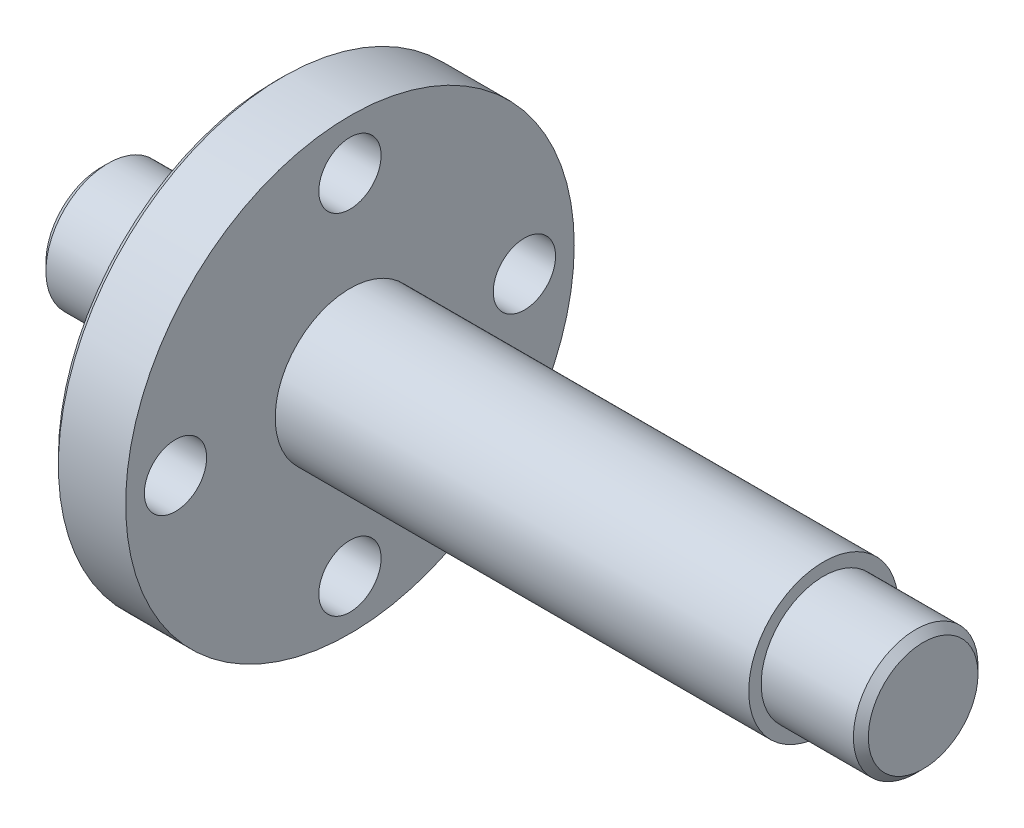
ISO-10303-21;
HEADER;
FILE_DESCRIPTION(('STEP AP214'),'2;1');
FILE_NAME('part.step','',(''),(''),'','','');
FILE_SCHEMA(('AUTOMOTIVE_DESIGN { 1 0 10303 214 1 1 1 1 }'));
ENDSEC;
DATA;
#1=APPLICATION_CONTEXT('core data for automotive mechanical design processes');
#2=APPLICATION_PROTOCOL_DEFINITION('international standard','automotive_design',2000,#1);
#3=PRODUCT_CONTEXT('',#1,'mechanical');
#4=PRODUCT('Part','Part','',(#3));
#5=PRODUCT_RELATED_PRODUCT_CATEGORY('part','',(#4));
#6=PRODUCT_DEFINITION_FORMATION('','',#4);
#7=PRODUCT_DEFINITION_CONTEXT('part definition',#1,'design');
#8=PRODUCT_DEFINITION('design','',#6,#7);
#9=PRODUCT_DEFINITION_SHAPE('','',#8);
#10=(LENGTH_UNIT() NAMED_UNIT(*) SI_UNIT(.MILLI.,.METRE.));
#11=(NAMED_UNIT(*) PLANE_ANGLE_UNIT() SI_UNIT($,.RADIAN.));
#12=(NAMED_UNIT(*) SI_UNIT($,.STERADIAN.) SOLID_ANGLE_UNIT());
#13=UNCERTAINTY_MEASURE_WITH_UNIT(LENGTH_MEASURE(1.E-05),#10,'distance_accuracy_value','');
#14=(GEOMETRIC_REPRESENTATION_CONTEXT(3) GLOBAL_UNCERTAINTY_ASSIGNED_CONTEXT((#13)) GLOBAL_UNIT_ASSIGNED_CONTEXT((#10,
#11,#12)) REPRESENTATION_CONTEXT('',''));
#15=CARTESIAN_POINT('',(0.,0.,0.));
#16=DIRECTION('',(0.,0.,1.));
#17=DIRECTION('',(1.,0.,0.));
#18=AXIS2_PLACEMENT_3D('',#15,#16,#17);
#19=CARTESIAN_POINT('',(44.,0.,0.));
#20=DIRECTION('',(1.,0.,0.));
#21=DIRECTION('',(0.,0.,-1.));
#22=AXIS2_PLACEMENT_3D('',#19,#20,#21);
#23=PLANE('',#22);
#24=CARTESIAN_POINT('',(44.,0.,0.));
#25=DIRECTION('',(1.,0.,0.));
#26=DIRECTION('',(0.,0.,-1.));
#27=AXIS2_PLACEMENT_3D('',#24,#25,#26);
#28=CIRCLE('',#27,3.);
#29=CARTESIAN_POINT('',(44.,0.,-3.));
#30=VERTEX_POINT('',#29);
#31=EDGE_CURVE('E161',#30,#30,#28,.T.);
#32=ORIENTED_EDGE('',*,*,#31,.T.);
#33=EDGE_LOOP('',(#32));
#34=FACE_BOUND('',#33,.T.);
#35=CARTESIAN_POINT('',(44.,0.,0.));
#36=DIRECTION('',(1.,0.,0.));
#37=DIRECTION('',(0.,0.,-1.));
#38=AXIS2_PLACEMENT_3D('',#35,#36,#37);
#39=CIRCLE('',#38,2.5);
#40=CARTESIAN_POINT('',(44.,0.,-2.5));
#41=VERTEX_POINT('',#40);
#42=EDGE_CURVE('E165',#41,#41,#39,.T.);
#43=ORIENTED_EDGE('',*,*,#42,.F.);
#44=EDGE_LOOP('',(#43));
#45=FACE_BOUND('',#44,.T.);
#46=ADVANCED_FACE('F36',(#34,#45),#23,.T.);
#47=CARTESIAN_POINT('',(25.,0.,0.));
#48=DIRECTION('',(1.,0.,0.));
#49=DIRECTION('',(0.,0.,-1.));
#50=AXIS2_PLACEMENT_3D('',#47,#48,#49);
#51=PLANE('',#50);
#52=CARTESIAN_POINT('',(25.,0.,-7.));
#53=DIRECTION('',(1.,0.,0.));
#54=DIRECTION('',(0.,0.,-1.));
#55=AXIS2_PLACEMENT_3D('',#52,#53,#54);
#56=CIRCLE('',#55,1.24999999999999);
#57=CARTESIAN_POINT('',(25.,0.,-8.24999999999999));
#58=VERTEX_POINT('',#57);
#59=EDGE_CURVE('E187',#58,#58,#56,.T.);
#60=ORIENTED_EDGE('',*,*,#59,.F.);
#61=EDGE_LOOP('',(#60));
#62=FACE_BOUND('',#61,.T.);
#63=CARTESIAN_POINT('',(25.,-7.,0.));
#64=DIRECTION('',(1.,0.,0.));
#65=DIRECTION('',(0.,0.,-1.));
#66=AXIS2_PLACEMENT_3D('',#63,#64,#65);
#67=CIRCLE('',#66,1.24999999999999);
#68=CARTESIAN_POINT('',(25.,-7.,-1.24999999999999));
#69=VERTEX_POINT('',#68);
#70=EDGE_CURVE('E181',#69,#69,#67,.T.);
#71=ORIENTED_EDGE('',*,*,#70,.F.);
#72=EDGE_LOOP('',(#71));
#73=FACE_BOUND('',#72,.T.);
#74=CARTESIAN_POINT('',(25.,0.,7.));
#75=DIRECTION('',(1.,0.,0.));
#76=DIRECTION('',(0.,0.,-1.));
#77=AXIS2_PLACEMENT_3D('',#74,#75,#76);
#78=CIRCLE('',#77,1.24999999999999);
#79=CARTESIAN_POINT('',(25.,0.,5.75000000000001));
#80=VERTEX_POINT('',#79);
#81=EDGE_CURVE('E175',#80,#80,#78,.T.);
#82=ORIENTED_EDGE('',*,*,#81,.F.);
#83=EDGE_LOOP('',(#82));
#84=FACE_BOUND('',#83,.T.);
#85=CARTESIAN_POINT('',(25.,7.,0.));
#86=DIRECTION('',(1.,0.,0.));
#87=DIRECTION('',(0.,0.,-1.));
#88=AXIS2_PLACEMENT_3D('',#85,#86,#87);
#89=CIRCLE('',#88,1.24999999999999);
#90=CARTESIAN_POINT('',(25.,7.,-1.24999999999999));
#91=VERTEX_POINT('',#90);
#92=EDGE_CURVE('E169',#91,#91,#89,.T.);
#93=ORIENTED_EDGE('',*,*,#92,.F.);
#94=EDGE_LOOP('',(#93));
#95=FACE_BOUND('',#94,.T.);
#96=CARTESIAN_POINT('',(25.,0.,0.));
#97=DIRECTION('',(1.,0.,0.));
#98=DIRECTION('',(0.,0.,-1.));
#99=AXIS2_PLACEMENT_3D('',#96,#97,#98);
#100=CIRCLE('',#99,9.);
#101=CARTESIAN_POINT('',(25.,0.,-9.));
#102=VERTEX_POINT('',#101);
#103=EDGE_CURVE('E156',#102,#102,#100,.T.);
#104=ORIENTED_EDGE('',*,*,#103,.T.);
#105=EDGE_LOOP('',(#104));
#106=FACE_BOUND('',#105,.T.);
#107=CARTESIAN_POINT('',(25.,0.,0.));
#108=DIRECTION('',(1.,0.,0.));
#109=DIRECTION('',(0.,0.,-1.));
#110=AXIS2_PLACEMENT_3D('',#107,#108,#109);
#111=CIRCLE('',#110,3.);
#112=CARTESIAN_POINT('',(25.,0.,-3.));
#113=VERTEX_POINT('',#112);
#114=EDGE_CURVE('E162',#113,#113,#111,.T.);
#115=ORIENTED_EDGE('',*,*,#114,.F.);
#116=EDGE_LOOP('',(#115));
#117=FACE_BOUND('',#116,.T.);
#118=ADVANCED_FACE('F83',(#62,#73,#84,#95,#106,#117),#51,.T.);
#119=CARTESIAN_POINT('',(15.,0.,0.));
#120=DIRECTION('',(1.,0.,0.));
#121=DIRECTION('',(0.,0.,-1.));
#122=AXIS2_PLACEMENT_3D('',#119,#120,#121);
#123=PLANE('',#122);
#124=CARTESIAN_POINT('',(15.,0.,0.));
#125=DIRECTION('',(1.,0.,0.));
#126=DIRECTION('',(0.,0.,-1.));
#127=AXIS2_PLACEMENT_3D('',#124,#125,#126);
#128=CIRCLE('',#127,2.2);
#129=CARTESIAN_POINT('',(15.,0.,-2.2));
#130=VERTEX_POINT('',#129);
#131=EDGE_CURVE('E10',#130,#130,#128,.F.);
#132=ORIENTED_EDGE('',*,*,#131,.T.);
#133=EDGE_LOOP('',(#132));
#134=FACE_BOUND('',#133,.T.);
#135=CARTESIAN_POINT('',(15.,0.,0.));
#136=DIRECTION('',(-1.,0.,0.));
#137=DIRECTION('',(0.,0.,1.));
#138=AXIS2_PLACEMENT_3D('',#135,#136,#137);
#139=CIRCLE('',#138,1.5);
#140=CARTESIAN_POINT('',(15.,0.,1.5));
#141=VERTEX_POINT('',#140);
#142=EDGE_CURVE('E192',#141,#141,#139,.T.);
#143=ORIENTED_EDGE('',*,*,#142,.F.);
#144=EDGE_LOOP('',(#143));
#145=FACE_BOUND('',#144,.T.);
#146=ADVANCED_FACE('F89',(#134,#145),#123,.F.);
#147=CARTESIAN_POINT('',(19.,0.,0.));
#148=DIRECTION('',(-1.,0.,0.));
#149=DIRECTION('',(0.,0.,1.));
#150=AXIS2_PLACEMENT_3D('',#147,#148,#149);
#151=CYLINDRICAL_SURFACE('',#150,2.5);
#152=CARTESIAN_POINT('',(15.3,0.,0.));
#153=DIRECTION('',(1.,0.,0.));
#154=DIRECTION('',(0.,0.,-1.));
#155=AXIS2_PLACEMENT_3D('',#152,#153,#154);
#156=CIRCLE('',#155,2.5);
#157=CARTESIAN_POINT('',(15.3,0.,-2.5));
#158=VERTEX_POINT('',#157);
#159=EDGE_CURVE('E43',#158,#158,#156,.T.);
#160=ORIENTED_EDGE('',*,*,#159,.T.);
#161=EDGE_LOOP('',(#160));
#162=FACE_BOUND('',#161,.T.);
#163=CARTESIAN_POINT('',(19.,0.,0.));
#164=DIRECTION('',(1.,0.,0.));
#165=DIRECTION('',(0.,0.,-1.));
#166=AXIS2_PLACEMENT_3D('',#163,#164,#165);
#167=CIRCLE('',#166,2.5);
#168=CARTESIAN_POINT('',(19.,0.,-2.5));
#169=VERTEX_POINT('',#168);
#170=EDGE_CURVE('E149',#169,#169,#167,.T.);
#171=ORIENTED_EDGE('',*,*,#170,.F.);
#172=EDGE_LOOP('',(#171));
#173=FACE_BOUND('',#172,.T.);
#174=ADVANCED_FACE('F113',(#162,#173),#151,.T.);
#175=CARTESIAN_POINT('',(19.,0.,0.));
#176=DIRECTION('',(1.,0.,0.));
#177=DIRECTION('',(0.,0.,-1.));
#178=AXIS2_PLACEMENT_3D('',#175,#176,#177);
#179=PLANE('',#178);
#180=CARTESIAN_POINT('',(19.,0.,0.));
#181=DIRECTION('',(1.,0.,0.));
#182=DIRECTION('',(0.,0.,-1.));
#183=AXIS2_PLACEMENT_3D('',#180,#181,#182);
#184=CIRCLE('',#183,3.);
#185=CARTESIAN_POINT('',(19.,0.,-3.));
#186=VERTEX_POINT('',#185);
#187=EDGE_CURVE('E153',#186,#186,#184,.T.);
#188=ORIENTED_EDGE('',*,*,#187,.F.);
#189=EDGE_LOOP('',(#188));
#190=FACE_BOUND('',#189,.T.);
#191=ORIENTED_EDGE('',*,*,#170,.T.);
#192=EDGE_LOOP('',(#191));
#193=FACE_BOUND('',#192,.T.);
#194=ADVANCED_FACE('F111',(#190,#193),#179,.F.);
#195=CARTESIAN_POINT('',(22.,0.,0.));
#196=DIRECTION('',(-1.,0.,0.));
#197=DIRECTION('',(0.,0.,1.));
#198=AXIS2_PLACEMENT_3D('',#195,#196,#197);
#199=CYLINDRICAL_SURFACE('',#198,3.);
#200=CARTESIAN_POINT('',(19.475,2.12132034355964,-2.12132034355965));
#201=CARTESIAN_POINT('',(19.4749994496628,2.08183053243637,-2.16081067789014));
#202=CARTESIAN_POINT('',(19.4795790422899,2.04123014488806,-2.19918499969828));
#203=CARTESIAN_POINT('',(19.4977169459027,1.95909170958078,-2.27266305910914));
#204=CARTESIAN_POINT('',(19.5112757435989,1.91755361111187,-2.30776661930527));
#205=CARTESIAN_POINT('',(19.5468496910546,1.83502148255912,-2.37391899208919));
#206=CARTESIAN_POINT('',(19.5688502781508,1.79402664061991,-2.40497466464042));
#207=CARTESIAN_POINT('',(19.6206158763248,1.71390737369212,-2.4627146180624));
#208=CARTESIAN_POINT('',(19.6503825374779,1.67478334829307,-2.4893979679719));
#209=CARTESIAN_POINT('',(19.7179648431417,1.59855037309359,-2.53904996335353));
#210=CARTESIAN_POINT('',(19.7560112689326,1.56154870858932,-2.56186913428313));
#211=CARTESIAN_POINT('',(19.8385826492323,1.49244550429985,-2.6027334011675));
#212=CARTESIAN_POINT('',(19.8831091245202,1.4603451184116,-2.62077737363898));
#213=CARTESIAN_POINT('',(19.9790376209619,1.40156887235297,-2.65268918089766));
#214=CARTESIAN_POINT('',(20.0306078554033,1.37508819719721,-2.66641294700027));
#215=CARTESIAN_POINT('',(20.1381553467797,1.33026886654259,-2.6890555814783));
#216=CARTESIAN_POINT('',(20.1941311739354,1.31192758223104,-2.69797600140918));
#217=CARTESIAN_POINT('',(20.3068306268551,1.28501655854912,-2.71089460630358));
#218=CARTESIAN_POINT('',(20.3634587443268,1.27612589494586,-2.71505484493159));
#219=CARTESIAN_POINT('',(20.4775508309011,1.2675795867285,-2.71905616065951));
#220=CARTESIAN_POINT('',(20.5350145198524,1.26792091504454,-2.71889865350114));
#221=CARTESIAN_POINT('',(20.6461954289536,1.27756478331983,-2.71437871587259));
#222=CARTESIAN_POINT('',(20.6999594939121,1.28643343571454,-2.71021987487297));
#223=CARTESIAN_POINT('',(20.8051273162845,1.31197142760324,-2.69794914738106));
#224=CARTESIAN_POINT('',(20.8565307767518,1.32864174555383,-2.68983676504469));
#225=CARTESIAN_POINT('',(20.9565219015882,1.36923073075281,-2.66940610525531));
#226=CARTESIAN_POINT('',(21.0050482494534,1.39326573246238,-2.65701988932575));
#227=CARTESIAN_POINT('',(21.0972308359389,1.44733716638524,-2.62795647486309));
#228=CARTESIAN_POINT('',(21.1408856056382,1.47737540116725,-2.61127798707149));
#229=CARTESIAN_POINT('',(21.2246119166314,1.54400376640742,-2.57247276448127));
#230=CARTESIAN_POINT('',(21.2643540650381,1.58086348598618,-2.55009671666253));
#231=CARTESIAN_POINT('',(21.3363383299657,1.65837887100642,-2.5003793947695));
#232=CARTESIAN_POINT('',(21.3685796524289,1.69903493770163,-2.4730375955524));
#233=CARTESIAN_POINT('',(21.4249303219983,1.78303607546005,-2.41318606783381));
#234=CARTESIAN_POINT('',(21.4489473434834,1.82640559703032,-2.38062333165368));
#235=CARTESIAN_POINT('',(21.4875046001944,1.91373952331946,-2.31099840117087));
#236=CARTESIAN_POINT('',(21.5020483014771,1.95770370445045,-2.27393785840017));
#237=CARTESIAN_POINT('',(21.5206530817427,2.0425987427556,-2.19792832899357));
#238=CARTESIAN_POINT('',(21.5251589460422,2.08357681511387,-2.15914080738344));
#239=CARTESIAN_POINT('',(21.5248325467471,2.16323793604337,-2.07932170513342));
#240=CARTESIAN_POINT('',(21.5200019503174,2.20192139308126,-2.03829052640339));
#241=CARTESIAN_POINT('',(21.5014893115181,2.27478481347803,-1.95659422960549));
#242=CARTESIAN_POINT('',(21.4880837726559,2.30906662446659,-1.91595659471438));
#243=CARTESIAN_POINT('',(21.4531509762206,2.37380679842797,-1.83513611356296));
#244=CARTESIAN_POINT('',(21.4316226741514,2.40426466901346,-1.79495332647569));
#245=CARTESIAN_POINT('',(21.3804131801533,2.46174646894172,-1.71530840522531));
#246=CARTESIAN_POINT('',(21.3505274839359,2.48865542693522,-1.67589505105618));
#247=CARTESIAN_POINT('',(21.2836898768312,2.53790663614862,-1.60033354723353));
#248=CARTESIAN_POINT('',(21.2467357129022,2.56024742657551,-1.56418644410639));
#249=CARTESIAN_POINT('',(21.1647203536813,2.60134825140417,-1.49488756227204));
#250=CARTESIAN_POINT('',(21.1193558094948,2.61988574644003,-1.46196192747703));
#251=CARTESIAN_POINT('',(21.0229481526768,2.65209803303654,-1.40268238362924));
#252=CARTESIAN_POINT('',(20.9719049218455,2.66577272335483,-1.3763286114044));
#253=CARTESIAN_POINT('',(20.8655030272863,2.68839022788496,-1.33161139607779));
#254=CARTESIAN_POINT('',(20.8101490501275,2.69733810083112,-1.31323941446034));
#255=CARTESIAN_POINT('',(20.6966910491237,2.71062596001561,-1.2855919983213));
#256=CARTESIAN_POINT('',(20.6385883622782,2.71496816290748,-1.27631218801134));
#257=CARTESIAN_POINT('',(20.5246525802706,2.71899283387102,-1.26771377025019));
#258=CARTESIAN_POINT('',(20.4688659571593,2.71891384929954,-1.26788520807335));
#259=CARTESIAN_POINT('',(20.3581622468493,2.7146849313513,-1.27691425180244));
#260=CARTESIAN_POINT('',(20.3032451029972,2.71053526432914,-1.28577128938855));
#261=CARTESIAN_POINT('',(20.1969908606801,2.69825135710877,-1.31134779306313));
#262=CARTESIAN_POINT('',(20.1456028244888,2.69020254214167,-1.32789840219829));
#263=CARTESIAN_POINT('',(20.0464364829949,2.67007779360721,-1.3679121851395));
#264=CARTESIAN_POINT('',(19.9986590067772,2.65800093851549,-1.39137694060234));
#265=CARTESIAN_POINT('',(19.9057159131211,2.62906423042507,-1.44533656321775));
#266=CARTESIAN_POINT('',(19.8607675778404,2.61201200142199,-1.47610239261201));
#267=CARTESIAN_POINT('',(19.777012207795,2.57325730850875,-1.54266924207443));
#268=CARTESIAN_POINT('',(19.7382069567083,2.55155349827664,-1.57847171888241));
#269=CARTESIAN_POINT('',(19.6662031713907,2.50243121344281,-1.65529415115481));
#270=CARTESIAN_POINT('',(19.6333061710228,2.47481206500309,-1.69646948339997));
#271=CARTESIAN_POINT('',(19.5761877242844,2.4145913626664,-1.78113516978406));
#272=CARTESIAN_POINT('',(19.5519645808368,2.38199078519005,-1.82462506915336));
#273=CARTESIAN_POINT('',(19.5135836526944,2.31322464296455,-1.91100802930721));
#274=CARTESIAN_POINT('',(19.49916315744,2.27718437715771,-1.95388373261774));
#275=CARTESIAN_POINT('',(19.4798731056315,2.2015959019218,-2.03867524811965));
#276=CARTESIAN_POINT('',(19.4750005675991,2.16204879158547,-2.08059135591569));
#277=CARTESIAN_POINT('',(19.475,2.12132034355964,-2.12132034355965));
#278=B_SPLINE_CURVE_WITH_KNOTS('',3,(#200,#201,#202,#203,#204,#205,#206,#207,#208,#209,#210,
#211,#212,#213,#214,#215,#216,#217,#218,#219,#220,#221,#222,#223,#224,#225,#226,#227,#228,#229,
#230,#231,#232,#233,#234,#235,#236,#237,#238,#239,#240,#241,#242,#243,#244,#245,#246,#247,#248,
#249,#250,#251,#252,#253,#254,#255,#256,#257,#258,#259,#260,#261,#262,#263,#264,#265,#266,#267,
#268,#269,#270,#271,#272,#273,#274,#275,#276,#277),.UNSPECIFIED.,.T.,.F.,(4,2,2,2,2,2,2,2,2,2,2,
2,2,2,2,2,2,2,2,2,2,2,2,2,2,2,2,2,2,2,2,2,2,2,2,2,2,2,4),(0.,0.167330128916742,
0.334669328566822,0.501721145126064,0.668808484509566,0.841343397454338,1.01391886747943,
1.19175498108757,1.36953361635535,1.54106091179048,1.71253196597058,1.87571592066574,
2.03892034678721,2.20484873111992,2.37082701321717,2.54593923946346,2.72106999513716,
2.89810683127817,3.07507885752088,3.24403854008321,3.41296805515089,3.57670753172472,
3.7404680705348,3.90865179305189,4.07688921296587,4.25317821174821,4.42947088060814,
4.60557449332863,4.78159331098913,4.94812460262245,5.11464499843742,5.27767170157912,
5.44073572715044,5.61120817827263,5.78173003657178,5.95936758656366,6.13697036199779,
6.30960288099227,6.48218148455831),.UNSPECIFIED.);
#279=CARTESIAN_POINT('',(19.475,2.12132034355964,-2.12132034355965));
#280=VERTEX_POINT('',#279);
#281=EDGE_CURVE('E47',#280,#280,#278,.T.);
#282=ORIENTED_EDGE('',*,*,#281,.T.);
#283=EDGE_LOOP('',(#282));
#284=FACE_BOUND('',#283,.T.);
#285=CARTESIAN_POINT('',(22.,0.,0.));
#286=DIRECTION('',(1.,0.,0.));
#287=DIRECTION('',(0.,0.,-1.));
#288=AXIS2_PLACEMENT_3D('',#285,#286,#287);
#289=CIRCLE('',#288,3.);
#290=CARTESIAN_POINT('',(22.,0.,-3.));
#291=VERTEX_POINT('',#290);
#292=EDGE_CURVE('E152',#291,#291,#289,.T.);
#293=ORIENTED_EDGE('',*,*,#292,.F.);
#294=EDGE_LOOP('',(#293));
#295=FACE_BOUND('',#294,.T.);
#296=ORIENTED_EDGE('',*,*,#187,.T.);
#297=EDGE_LOOP('',(#296));
#298=FACE_BOUND('',#297,.T.);
#299=ADVANCED_FACE('F106',(#284,#295,#298),#199,.T.);
#300=CARTESIAN_POINT('',(22.,0.,0.));
#301=DIRECTION('',(1.,0.,0.));
#302=DIRECTION('',(0.,0.,-1.));
#303=AXIS2_PLACEMENT_3D('',#300,#301,#302);
#304=PLANE('',#303);
#305=CARTESIAN_POINT('',(22.,0.,0.));
#306=DIRECTION('',(1.,0.,0.));
#307=DIRECTION('',(0.,0.,-1.));
#308=AXIS2_PLACEMENT_3D('',#305,#306,#307);
#309=CIRCLE('',#308,8.70000000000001);
#310=CARTESIAN_POINT('',(22.,0.,-8.70000000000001));
#311=VERTEX_POINT('',#310);
#312=EDGE_CURVE('E141',#311,#311,#309,.F.);
#313=ORIENTED_EDGE('',*,*,#312,.T.);
#314=EDGE_LOOP('',(#313));
#315=FACE_BOUND('',#314,.T.);
#316=CARTESIAN_POINT('',(22.,0.,-7.));
#317=DIRECTION('',(-1.,0.,0.));
#318=DIRECTION('',(0.,0.,1.));
#319=AXIS2_PLACEMENT_3D('',#316,#317,#318);
#320=CIRCLE('',#319,1.24999999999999);
#321=CARTESIAN_POINT('',(22.,0.,-5.75000000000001));
#322=VERTEX_POINT('',#321);
#323=EDGE_CURVE('E60',#322,#322,#320,.T.);
#324=ORIENTED_EDGE('',*,*,#323,.F.);
#325=EDGE_LOOP('',(#324));
#326=FACE_BOUND('',#325,.T.);
#327=CARTESIAN_POINT('',(22.,-7.,0.));
#328=DIRECTION('',(-1.,0.,0.));
#329=DIRECTION('',(0.,0.,1.));
#330=AXIS2_PLACEMENT_3D('',#327,#328,#329);
#331=CIRCLE('',#330,1.24999999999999);
#332=CARTESIAN_POINT('',(22.,-7.,1.24999999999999));
#333=VERTEX_POINT('',#332);
#334=EDGE_CURVE('E184',#333,#333,#331,.T.);
#335=ORIENTED_EDGE('',*,*,#334,.F.);
#336=EDGE_LOOP('',(#335));
#337=FACE_BOUND('',#336,.T.);
#338=CARTESIAN_POINT('',(22.,0.,7.));
#339=DIRECTION('',(-1.,0.,0.));
#340=DIRECTION('',(0.,0.,1.));
#341=AXIS2_PLACEMENT_3D('',#338,#339,#340);
#342=CIRCLE('',#341,1.24999999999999);
#343=CARTESIAN_POINT('',(22.,0.,8.24999999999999));
#344=VERTEX_POINT('',#343);
#345=EDGE_CURVE('E178',#344,#344,#342,.T.);
#346=ORIENTED_EDGE('',*,*,#345,.F.);
#347=EDGE_LOOP('',(#346));
#348=FACE_BOUND('',#347,.T.);
#349=CARTESIAN_POINT('',(22.,7.,0.));
#350=DIRECTION('',(-1.,0.,0.));
#351=DIRECTION('',(0.,0.,1.));
#352=AXIS2_PLACEMENT_3D('',#349,#350,#351);
#353=CIRCLE('',#352,1.24999999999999);
#354=CARTESIAN_POINT('',(22.,7.,1.24999999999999));
#355=VERTEX_POINT('',#354);
#356=EDGE_CURVE('E172',#355,#355,#353,.T.);
#357=ORIENTED_EDGE('',*,*,#356,.F.);
#358=EDGE_LOOP('',(#357));
#359=FACE_BOUND('',#358,.T.);
#360=ORIENTED_EDGE('',*,*,#292,.T.);
#361=EDGE_LOOP('',(#360));
#362=FACE_BOUND('',#361,.T.);
#363=ADVANCED_FACE('F103',(#315,#326,#337,#348,#359,#362),#304,.F.);
#364=CARTESIAN_POINT('',(25.,0.,0.));
#365=DIRECTION('',(-1.,0.,0.));
#366=DIRECTION('',(0.,0.,1.));
#367=AXIS2_PLACEMENT_3D('',#364,#365,#366);
#368=CYLINDRICAL_SURFACE('',#367,9.);
#369=CARTESIAN_POINT('',(22.3,0.,0.));
#370=DIRECTION('',(1.,0.,0.));
#371=DIRECTION('',(0.,0.,-1.));
#372=AXIS2_PLACEMENT_3D('',#369,#370,#371);
#373=CIRCLE('',#372,9.);
#374=CARTESIAN_POINT('',(22.3,0.,-9.));
#375=VERTEX_POINT('',#374);
#376=EDGE_CURVE('E144',#375,#375,#373,.T.);
#377=ORIENTED_EDGE('',*,*,#376,.T.);
#378=EDGE_LOOP('',(#377));
#379=FACE_BOUND('',#378,.T.);
#380=ORIENTED_EDGE('',*,*,#103,.F.);
#381=EDGE_LOOP('',(#380));
#382=FACE_BOUND('',#381,.T.);
#383=ADVANCED_FACE('F100',(#379,#382),#368,.T.);
#384=CARTESIAN_POINT('',(44.,0.,0.));
#385=DIRECTION('',(-1.,0.,0.));
#386=DIRECTION('',(0.,0.,1.));
#387=AXIS2_PLACEMENT_3D('',#384,#385,#386);
#388=CYLINDRICAL_SURFACE('',#387,3.);
#389=ORIENTED_EDGE('',*,*,#31,.F.);
#390=EDGE_LOOP('',(#389));
#391=FACE_BOUND('',#390,.T.);
#392=ORIENTED_EDGE('',*,*,#114,.T.);
#393=EDGE_LOOP('',(#392));
#394=FACE_BOUND('',#393,.T.);
#395=ADVANCED_FACE('F98',(#391,#394),#388,.T.);
#396=CARTESIAN_POINT('',(48.,0.,0.));
#397=DIRECTION('',(-1.,0.,0.));
#398=DIRECTION('',(0.,0.,1.));
#399=AXIS2_PLACEMENT_3D('',#396,#397,#398);
#400=CYLINDRICAL_SURFACE('',#399,2.5);
#401=CARTESIAN_POINT('',(47.7,0.,0.));
#402=DIRECTION('',(1.,0.,0.));
#403=DIRECTION('',(0.,0.,-1.));
#404=AXIS2_PLACEMENT_3D('',#401,#402,#403);
#405=CIRCLE('',#404,2.5);
#406=CARTESIAN_POINT('',(47.7,0.,-2.5));
#407=VERTEX_POINT('',#406);
#408=EDGE_CURVE('E51',#407,#407,#405,.F.);
#409=ORIENTED_EDGE('',*,*,#408,.T.);
#410=EDGE_LOOP('',(#409));
#411=FACE_BOUND('',#410,.T.);
#412=ORIENTED_EDGE('',*,*,#42,.T.);
#413=EDGE_LOOP('',(#412));
#414=FACE_BOUND('',#413,.T.);
#415=ADVANCED_FACE('F96',(#411,#414),#400,.T.);
#416=CARTESIAN_POINT('',(48.,0.,0.));
#417=DIRECTION('',(1.,0.,0.));
#418=DIRECTION('',(0.,0.,-1.));
#419=AXIS2_PLACEMENT_3D('',#416,#417,#418);
#420=PLANE('',#419);
#421=CARTESIAN_POINT('',(48.,0.,0.));
#422=DIRECTION('',(1.,0.,0.));
#423=DIRECTION('',(0.,0.,-1.));
#424=AXIS2_PLACEMENT_3D('',#421,#422,#423);
#425=CIRCLE('',#424,2.20000000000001);
#426=CARTESIAN_POINT('',(48.,0.,-2.20000000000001));
#427=VERTEX_POINT('',#426);
#428=EDGE_CURVE('E139',#427,#427,#425,.T.);
#429=ORIENTED_EDGE('',*,*,#428,.T.);
#430=EDGE_LOOP('',(#429));
#431=FACE_BOUND('',#430,.T.);
#432=ADVANCED_FACE('F226',(#431),#420,.T.);
#433=CARTESIAN_POINT('',(22.,7.,0.));
#434=DIRECTION('',(-1.,0.,0.));
#435=DIRECTION('',(0.,0.,1.));
#436=AXIS2_PLACEMENT_3D('',#433,#434,#435);
#437=CYLINDRICAL_SURFACE('',#436,1.24999999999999);
#438=ORIENTED_EDGE('',*,*,#356,.T.);
#439=EDGE_LOOP('',(#438));
#440=FACE_BOUND('',#439,.T.);
#441=ORIENTED_EDGE('',*,*,#92,.T.);
#442=EDGE_LOOP('',(#441));
#443=FACE_BOUND('',#442,.T.);
#444=ADVANCED_FACE('F222',(#440,#443),#437,.F.);
#445=CARTESIAN_POINT('',(22.,0.,7.));
#446=DIRECTION('',(-1.,0.,0.));
#447=DIRECTION('',(0.,0.,1.));
#448=AXIS2_PLACEMENT_3D('',#445,#446,#447);
#449=CYLINDRICAL_SURFACE('',#448,1.24999999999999);
#450=ORIENTED_EDGE('',*,*,#345,.T.);
#451=EDGE_LOOP('',(#450));
#452=FACE_BOUND('',#451,.T.);
#453=ORIENTED_EDGE('',*,*,#81,.T.);
#454=EDGE_LOOP('',(#453));
#455=FACE_BOUND('',#454,.T.);
#456=ADVANCED_FACE('F225',(#452,#455),#449,.F.);
#457=CARTESIAN_POINT('',(22.,-7.,0.));
#458=DIRECTION('',(-1.,0.,0.));
#459=DIRECTION('',(0.,0.,1.));
#460=AXIS2_PLACEMENT_3D('',#457,#458,#459);
#461=CYLINDRICAL_SURFACE('',#460,1.24999999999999);
#462=ORIENTED_EDGE('',*,*,#334,.T.);
#463=EDGE_LOOP('',(#462));
#464=FACE_BOUND('',#463,.T.);
#465=ORIENTED_EDGE('',*,*,#70,.T.);
#466=EDGE_LOOP('',(#465));
#467=FACE_BOUND('',#466,.T.);
#468=ADVANCED_FACE('F240',(#464,#467),#461,.F.);
#469=CARTESIAN_POINT('',(22.,0.,-7.));
#470=DIRECTION('',(-1.,0.,0.));
#471=DIRECTION('',(0.,0.,1.));
#472=AXIS2_PLACEMENT_3D('',#469,#470,#471);
#473=CYLINDRICAL_SURFACE('',#472,1.24999999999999);
#474=ORIENTED_EDGE('',*,*,#323,.T.);
#475=EDGE_LOOP('',(#474));
#476=FACE_BOUND('',#475,.T.);
#477=ORIENTED_EDGE('',*,*,#59,.T.);
#478=EDGE_LOOP('',(#477));
#479=FACE_BOUND('',#478,.T.);
#480=ADVANCED_FACE('F126',(#476,#479),#473,.F.);
#481=CARTESIAN_POINT('',(22.3,0.,0.));
#482=DIRECTION('',(1.,0.,0.));
#483=DIRECTION('',(0.,0.,-1.));
#484=AXIS2_PLACEMENT_3D('',#481,#482,#483);
#485=CONICAL_SURFACE('',#484,9.,0.78539816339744);
#486=ORIENTED_EDGE('',*,*,#312,.F.);
#487=EDGE_LOOP('',(#486));
#488=FACE_BOUND('',#487,.T.);
#489=ORIENTED_EDGE('',*,*,#376,.F.);
#490=EDGE_LOOP('',(#489));
#491=FACE_BOUND('',#490,.T.);
#492=ADVANCED_FACE('F123',(#488,#491),#485,.T.);
#493=CARTESIAN_POINT('',(48.,0.,0.));
#494=DIRECTION('',(-1.,0.,0.));
#495=DIRECTION('',(0.,0.,1.));
#496=AXIS2_PLACEMENT_3D('',#493,#494,#495);
#497=CONICAL_SURFACE('',#496,2.20000000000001,0.785398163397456);
#498=ORIENTED_EDGE('',*,*,#408,.F.);
#499=EDGE_LOOP('',(#498));
#500=FACE_BOUND('',#499,.T.);
#501=ORIENTED_EDGE('',*,*,#428,.F.);
#502=EDGE_LOOP('',(#501));
#503=FACE_BOUND('',#502,.T.);
#504=ADVANCED_FACE('F125',(#500,#503),#497,.T.);
#505=CARTESIAN_POINT('',(20.5,0.,0.));
#506=DIRECTION('',(0.,-0.707106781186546,0.707106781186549));
#507=DIRECTION('',(0.,-0.707106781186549,-0.707106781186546));
#508=AXIS2_PLACEMENT_3D('',#505,#506,#507);
#509=CYLINDRICAL_SURFACE('',#508,1.025);
#510=CARTESIAN_POINT('',(20.5,0.0496104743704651,-1.49917937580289));
#511=CARTESIAN_POINT('',(20.5496121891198,0.0496184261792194,-1.49918171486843));
#512=CARTESIAN_POINT('',(20.5992532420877,0.0546124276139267,-1.49903927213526));
#513=CARTESIAN_POINT('',(20.6967276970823,0.0738736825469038,-1.49820801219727));
#514=CARTESIAN_POINT('',(20.7445570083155,0.0881607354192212,-1.49751802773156));
#515=CARTESIAN_POINT('',(20.8366650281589,0.124144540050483,-1.49496030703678));
#516=CARTESIAN_POINT('',(20.8809752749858,0.145763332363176,-1.49310479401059));
#517=CARTESIAN_POINT('',(20.9660953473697,0.194780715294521,-1.48750416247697));
#518=CARTESIAN_POINT('',(21.0069046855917,0.222180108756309,-1.48375878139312));
#519=CARTESIAN_POINT('',(21.091244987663,0.2863054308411,-1.47283834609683));
#520=CARTESIAN_POINT('',(21.1341130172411,0.323824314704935,-1.46519916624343));
#521=CARTESIAN_POINT('',(21.21446896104,0.403242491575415,-1.44536330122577));
#522=CARTESIAN_POINT('',(21.251950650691,0.445146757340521,-1.43316140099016));
#523=CARTESIAN_POINT('',(21.3262635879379,0.53866010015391,-1.4009477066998));
#524=CARTESIAN_POINT('',(21.3620892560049,0.590765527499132,-1.38001713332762));
#525=CARTESIAN_POINT('',(21.4242055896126,0.696563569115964,-1.32974002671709));
#526=CARTESIAN_POINT('',(21.4505142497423,0.750252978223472,-1.30040956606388));
#527=CARTESIAN_POINT('',(21.4865675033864,0.842725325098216,-1.24177055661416));
#528=CARTESIAN_POINT('',(21.4988363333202,0.881772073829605,-1.21441846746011));
#529=CARTESIAN_POINT('',(21.5166259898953,0.957971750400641,-1.155252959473));
#530=CARTESIAN_POINT('',(21.5221520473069,0.99512612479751,-1.12344302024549));
#531=CARTESIAN_POINT('',(21.5261496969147,1.06638240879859,-1.05604833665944));
#532=CARTESIAN_POINT('',(21.5246089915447,1.10047889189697,-1.02045711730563));
#533=CARTESIAN_POINT('',(21.5145378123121,1.16456832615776,-0.946662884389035));
#534=CARTESIAN_POINT('',(21.5060053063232,1.19456008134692,-0.908459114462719));
#535=CARTESIAN_POINT('',(21.4826455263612,1.2493288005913,-0.831485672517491));
#536=CARTESIAN_POINT('',(21.4679426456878,1.27419507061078,-0.792741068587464));
#537=CARTESIAN_POINT('',(21.4329013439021,1.31931399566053,-0.71514179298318));
#538=CARTESIAN_POINT('',(21.4125618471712,1.3395657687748,-0.676287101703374));
#539=CARTESIAN_POINT('',(21.3643286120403,1.37768708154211,-0.59515292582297));
#540=CARTESIAN_POINT('',(21.3358419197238,1.39503108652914,-0.552980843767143));
#541=CARTESIAN_POINT('',(21.2734510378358,1.42482240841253,-0.470946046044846));
#542=CARTESIAN_POINT('',(21.2395406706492,1.43726408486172,-0.431086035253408));
#543=CARTESIAN_POINT('',(21.1606363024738,1.45972836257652,-0.348323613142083));
#544=CARTESIAN_POINT('',(21.1147386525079,1.46897247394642,-0.30606811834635));
#545=CARTESIAN_POINT('',(21.0168090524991,1.48302496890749,-0.228451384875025));
#546=CARTESIAN_POINT('',(20.964780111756,1.48783551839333,-0.19308678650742));
#547=CARTESIAN_POINT('',(20.8680635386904,1.49370526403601,-0.13927571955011));
#548=CARTESIAN_POINT('',(20.8245446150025,1.49538214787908,-0.118806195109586));
#549=CARTESIAN_POINT('',(20.7347811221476,1.49767926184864,-0.0851138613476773));
#550=CARTESIAN_POINT('',(20.6885417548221,1.4983014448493,-0.0718776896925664));
#551=CARTESIAN_POINT('',(20.5939617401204,1.4990564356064,-0.0540025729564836));
#552=CARTESIAN_POINT('',(20.5456064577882,1.49918499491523,-0.0494384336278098));
#553=CARTESIAN_POINT('',(20.4489300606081,1.49917342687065,-0.0497924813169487));
#554=CARTESIAN_POINT('',(20.4006089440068,1.49903331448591,-0.054710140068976));
#555=CARTESIAN_POINT('',(20.3113680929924,1.49828106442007,-0.0722129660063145));
#556=CARTESIAN_POINT('',(20.270248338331,1.49772664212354,-0.0838237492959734));
#557=CARTESIAN_POINT('',(20.1901229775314,1.49582082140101,-0.11283226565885));
#558=CARTESIAN_POINT('',(20.1511194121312,1.49446866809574,-0.130235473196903));
#559=CARTESIAN_POINT('',(20.0583893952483,1.48958882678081,-0.178762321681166));
#560=CARTESIAN_POINT('',(20.0060789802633,1.48534938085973,-0.212521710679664));
#561=CARTESIAN_POINT('',(19.9073396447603,1.47274113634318,-0.287178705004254));
#562=CARTESIAN_POINT('',(19.8609220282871,1.4643645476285,-0.328089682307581));
#563=CARTESIAN_POINT('',(19.7738498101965,1.44200279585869,-0.415569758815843));
#564=CARTESIAN_POINT('',(19.7332916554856,1.42793572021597,-0.46221425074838));
#565=CARTESIAN_POINT('',(19.6596905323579,1.39300063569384,-0.558725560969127));
#566=CARTESIAN_POINT('',(19.626635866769,1.37214333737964,-0.608587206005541));
#567=CARTESIAN_POINT('',(19.5742467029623,1.32704576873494,-0.700791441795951));
#568=CARTESIAN_POINT('',(19.5535269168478,1.30401962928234,-0.742938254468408));
#569=CARTESIAN_POINT('',(19.518905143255,1.25255925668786,-0.826744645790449));
#570=CARTESIAN_POINT('',(19.5049988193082,1.22412847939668,-0.868404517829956));
#571=CARTESIAN_POINT('',(19.4846982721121,1.16199630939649,-0.949948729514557));
#572=CARTESIAN_POINT('',(19.4783418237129,1.12826936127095,-0.989823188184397));
#573=CARTESIAN_POINT('',(19.4736868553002,1.05654374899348,-1.06604443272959));
#574=CARTESIAN_POINT('',(19.475386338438,1.01854614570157,-1.10239209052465));
#575=CARTESIAN_POINT('',(19.4862384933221,0.942981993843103,-1.1675033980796));
#576=CARTESIAN_POINT('',(19.4947526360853,0.905647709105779,-1.19664772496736));
#577=CARTESIAN_POINT('',(19.5179859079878,0.829735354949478,-1.25048235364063));
#578=CARTESIAN_POINT('',(19.5327063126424,0.791157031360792,-1.27517173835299));
#579=CARTESIAN_POINT('',(19.568560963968,0.712063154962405,-1.32104353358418));
#580=CARTESIAN_POINT('',(19.5899674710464,0.671542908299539,-1.34200270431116));
#581=CARTESIAN_POINT('',(19.6381547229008,0.591549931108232,-1.37913611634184));
#582=CARTESIAN_POINT('',(19.6649367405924,0.552077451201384,-1.39530922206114));
#583=CARTESIAN_POINT('',(19.7278478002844,0.46910414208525,-1.42554687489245));
#584=CARTESIAN_POINT('',(19.7647846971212,0.425948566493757,-1.43887765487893));
#585=CARTESIAN_POINT('',(19.8444058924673,0.343767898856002,-1.46069758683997));
#586=CARTESIAN_POINT('',(19.8871028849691,0.304752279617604,-1.46917582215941));
#587=CARTESIAN_POINT('',(19.9839856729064,0.227663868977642,-1.48320564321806));
#588=CARTESIAN_POINT('',(20.0389441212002,0.190448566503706,-1.48819893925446));
#589=CARTESIAN_POINT('',(20.1550170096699,0.127067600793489,-1.49495097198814));
#590=CARTESIAN_POINT('',(20.2161045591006,0.100856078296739,-1.49672323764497));
#591=CARTESIAN_POINT('',(20.3151771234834,0.0715758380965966,-1.49832848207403));
#592=CARTESIAN_POINT('',(20.3516624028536,0.0633999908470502,-1.49866956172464));
#593=CARTESIAN_POINT('',(20.425426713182,0.0524160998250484,-1.49909404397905));
#594=CARTESIAN_POINT('',(20.462705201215,0.049604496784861,-1.49917761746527));
#595=CARTESIAN_POINT('',(20.5,0.0496104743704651,-1.49917937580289));
#596=B_SPLINE_CURVE_WITH_KNOTS('',3,(#510,#511,#512,#513,#514,#515,#516,#517,#518,#519,#520,
#521,#522,#523,#524,#525,#526,#527,#528,#529,#530,#531,#532,#533,#534,#535,#536,#537,#538,#539,
#540,#541,#542,#543,#544,#545,#546,#547,#548,#549,#550,#551,#552,#553,#554,#555,#556,#557,#558,
#559,#560,#561,#562,#563,#564,#565,#566,#567,#568,#569,#570,#571,#572,#573,#574,#575,#576,#577,
#578,#579,#580,#581,#582,#583,#584,#585,#586,#587,#588,#589,#590,#591,#592,#593,#594,#595),
.UNSPECIFIED.,.T.,.F.,(4,2,2,2,2,2,2,2,2,2,2,2,2,2,2,2,2,2,2,2,2,2,2,2,2,2,2,2,2,2,2,2,2,2,2,2,
2,2,2,2,2,2,4),(0.,0.148660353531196,0.297638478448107,0.445079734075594,0.592541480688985,
0.764347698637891,0.93635088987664,1.13507427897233,1.33341993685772,1.48046447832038,
1.62739487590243,1.77458105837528,1.92181003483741,2.06620358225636,2.21062470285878,
2.37131861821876,2.53219688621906,2.72060994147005,2.90893090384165,3.05277036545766,
3.19634320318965,3.3411489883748,3.4859467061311,3.61363952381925,3.74145336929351,
3.92766922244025,4.11423705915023,4.30359187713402,4.49264945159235,4.64891740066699,
4.80508576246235,4.96203224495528,5.11893982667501,5.26265765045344,5.40640502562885,
5.55700379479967,5.7076382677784,5.88200760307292,6.05676768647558,6.25541030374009,
6.45321663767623,6.56504279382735,6.67679472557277),.UNSPECIFIED.);
#597=CARTESIAN_POINT('',(20.5,0.0496104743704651,-1.49917937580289));
#598=VERTEX_POINT('',#597);
#599=EDGE_CURVE('E54',#598,#598,#596,.T.);
#600=ORIENTED_EDGE('',*,*,#599,.T.);
#601=EDGE_LOOP('',(#600));
#602=FACE_BOUND('',#601,.T.);
#603=ORIENTED_EDGE('',*,*,#281,.F.);
#604=EDGE_LOOP('',(#603));
#605=FACE_BOUND('',#604,.T.);
#606=ADVANCED_FACE('F66',(#602,#605),#509,.F.);
#607=CARTESIAN_POINT('',(25.,0.,0.));
#608=DIRECTION('',(-1.,0.,0.));
#609=DIRECTION('',(0.,0.,1.));
#610=AXIS2_PLACEMENT_3D('',#607,#608,#609);
#611=CYLINDRICAL_SURFACE('',#610,1.5);
#612=ORIENTED_EDGE('',*,*,#142,.T.);
#613=EDGE_LOOP('',(#612));
#614=FACE_BOUND('',#613,.T.);
#615=CARTESIAN_POINT('',(25.,0.,0.));
#616=DIRECTION('',(-1.,0.,0.));
#617=DIRECTION('',(0.,0.,1.));
#618=AXIS2_PLACEMENT_3D('',#615,#616,#617);
#619=CIRCLE('',#618,1.5);
#620=CARTESIAN_POINT('',(25.,0.,1.5));
#621=VERTEX_POINT('',#620);
#622=EDGE_CURVE('E61',#621,#621,#619,.T.);
#623=ORIENTED_EDGE('',*,*,#622,.F.);
#624=EDGE_LOOP('',(#623));
#625=FACE_BOUND('',#624,.T.);
#626=ORIENTED_EDGE('',*,*,#599,.F.);
#627=EDGE_LOOP('',(#626));
#628=FACE_BOUND('',#627,.T.);
#629=ADVANCED_FACE('F69',(#614,#625,#628),#611,.F.);
#630=CARTESIAN_POINT('',(25.,0.,0.));
#631=DIRECTION('',(-1.,0.,0.));
#632=DIRECTION('',(0.,0.,1.));
#633=AXIS2_PLACEMENT_3D('',#630,#631,#632);
#634=PLANE('',#633);
#635=ORIENTED_EDGE('',*,*,#622,.T.);
#636=EDGE_LOOP('',(#635));
#637=FACE_BOUND('',#636,.T.);
#638=ADVANCED_FACE('F73',(#637),#634,.T.);
#639=CARTESIAN_POINT('',(15.3,0.,0.));
#640=DIRECTION('',(1.,0.,0.));
#641=DIRECTION('',(0.,0.,-1.));
#642=AXIS2_PLACEMENT_3D('',#639,#640,#641);
#643=CONICAL_SURFACE('',#642,2.5,0.785398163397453);
#644=ORIENTED_EDGE('',*,*,#131,.F.);
#645=EDGE_LOOP('',(#644));
#646=FACE_BOUND('',#645,.T.);
#647=ORIENTED_EDGE('',*,*,#159,.F.);
#648=EDGE_LOOP('',(#647));
#649=FACE_BOUND('',#648,.T.);
#650=ADVANCED_FACE('F38',(#646,#649),#643,.T.);
#651=CLOSED_SHELL('',(#46,#118,#146,#174,#194,#299,#363,#383,#395,#415,#432,#444,#456,#468,#480,
#492,#504,#606,#629,#638,#650));
#652=MANIFOLD_SOLID_BREP('B2',#651);
#653=ADVANCED_BREP_SHAPE_REPRESENTATION('',(#18,#652),#14);
#654=SHAPE_DEFINITION_REPRESENTATION(#9,#653);
ENDSEC;
END-ISO-10303-21;
